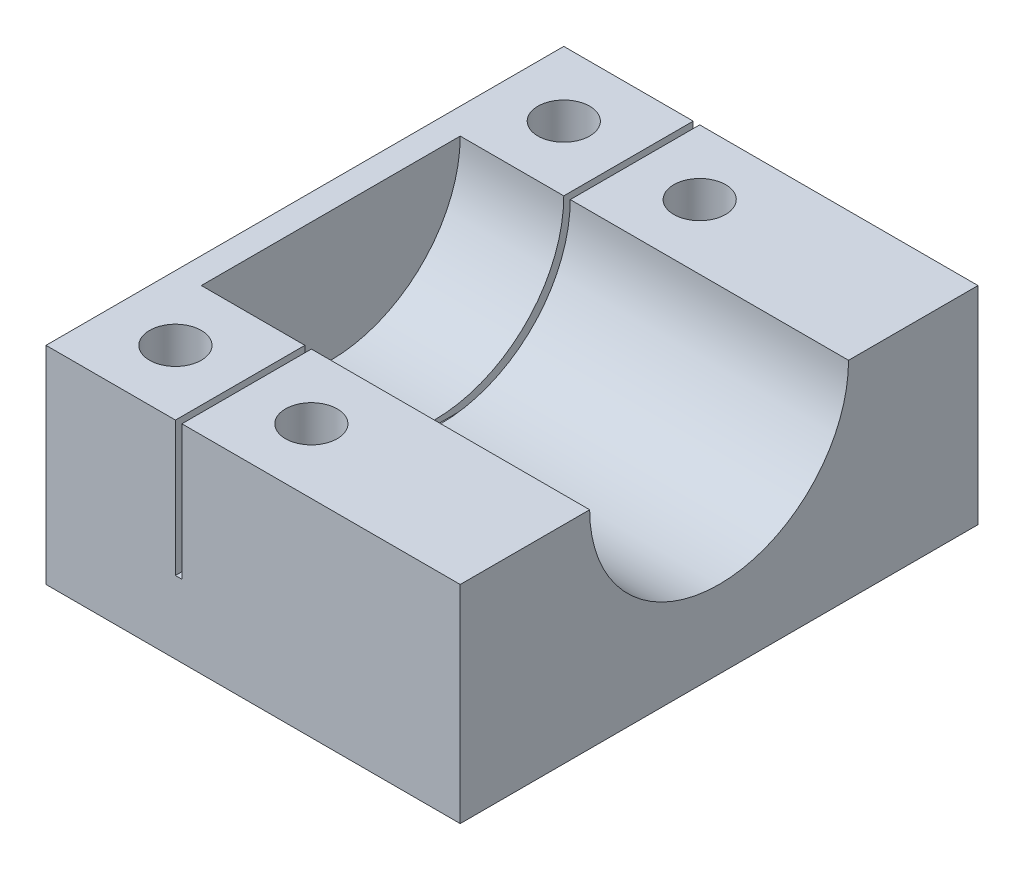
from build123d import *

# Parameters (mm, degrees)
SKETCH1_W               = 101.6
SKETCH1_H               = 127
BOSS_EXTRUDE1_DEPTH     = 50.8
CUT_EXTRUDE1_DEPTH      = 171.388379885
CUT_EXTRUDE1_DEPTH_BACK = 95.25
SKETCH3_R               = 31.75
SKETCH7_W               = 1.5875
SKETCH7_H               = 31.75
SKETCH7_H_2             = 63.5
CUT_EXTRUDE4_DEPTH      = 33.02
CUT_EXTRUDE5_DEPTH      = 6.35
CUT_EXTRUDE7_DEPTH      = 171.388379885
CUT_EXTRUDE7_DEPTH_BACK = 171.388379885
SKETCH10_R              = 6.35


with BuildPart() as part:
    # Sketch1 → Boss-Extrude1 (new body)
    with BuildSketch(Plane(origin=(0, 0, 0), x_dir=(1, 0, 0), z_dir=(0, 1, 0))):
        with Locations((50.8, 63.5)):
            Rectangle(SKETCH1_W, SKETCH1_H)
    extrude(amount=BOSS_EXTRUDE1_DEPTH)

    # Sketch3 → Cut-Extrude1 (cut, two sides: drawn at the far end of the back side and taken through both)
    with BuildSketch(Plane(origin=(101.6, 0, 0), x_dir=(0, 0, -1), z_dir=(1, 0, 0)).offset(-CUT_EXTRUDE1_DEPTH_BACK)):
        with Locations((63.5, 50.8)):
            Circle(SKETCH3_R)
    extrude(amount=CUT_EXTRUDE1_DEPTH + CUT_EXTRUDE1_DEPTH_BACK, mode=Mode.SUBTRACT)

    # Sketch7 → Cut-Extrude4 (cut)
    with BuildSketch(Plane(origin=(0, 50.8, 0), x_dir=(1, 0, 0), z_dir=(0, 1, 0))):
        with Locations((32.54375, 15.875)):
            Rectangle(SKETCH7_W, SKETCH7_H)
        with Locations((32.54375, 63.5)):
            Rectangle(SKETCH7_W, SKETCH7_H_2)
        with Locations((32.54375, 111.125)):
            Rectangle(SKETCH7_W, SKETCH7_H)
    extrude(amount=-CUT_EXTRUDE4_DEPTH, mode=Mode.SUBTRACT)

    # Sketch8 → Cut-Extrude5 (cut)
    with BuildSketch(Plane.XZ):
        Polygon((25.4, -10.375738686), (15.875, -4.876477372), (6.35, -10.375738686), (6.35, -21.374261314), (15.875, -26.873522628), (25.4, -21.374261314), align=None)
        Polygon((58.7375, -21.374261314), (58.7375, -10.375738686), (49.2125, -4.876477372), (39.6875, -10.375738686), (39.6875, -21.374261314), (49.2125, -26.873522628), align=None)
        Polygon((58.7375, -105.625738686), (49.2125, -100.126477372), (39.6875, -105.625738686), (39.6875, -116.624261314), (49.2125, -122.123522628), (58.7375, -116.624261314), align=None)
        Polygon((25.4, -105.625738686), (15.875, -100.126477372), (6.35, -105.625738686), (6.35, -116.624261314), (15.875, -122.123522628), (25.4, -116.624261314), align=None)
    extrude(amount=-CUT_EXTRUDE5_DEPTH, mode=Mode.SUBTRACT)

    # Sketch10 → Cut-Extrude7 (cut, two sides: drawn at the far end of the back side and taken through both)
    with BuildSketch(Plane.XZ.offset(-CUT_EXTRUDE7_DEPTH_BACK)):
        with Locations(Location((15.875, -111.125, 0), (0, 0, 270))):
            Circle(SKETCH10_R)
        with Locations(Location((49.2125, -111.125, 0), (0, 0, 270))):
            Circle(SKETCH10_R)
        with Locations(Location((49.2125, -15.875, 0), (0, 0, 270))):
            Circle(SKETCH10_R)
        with Locations(Location((15.875, -15.875, 0), (0, 0, 270))):
            Circle(SKETCH10_R)
    extrude(amount=CUT_EXTRUDE7_DEPTH + CUT_EXTRUDE7_DEPTH_BACK, mode=Mode.SUBTRACT)


solid = part.part
